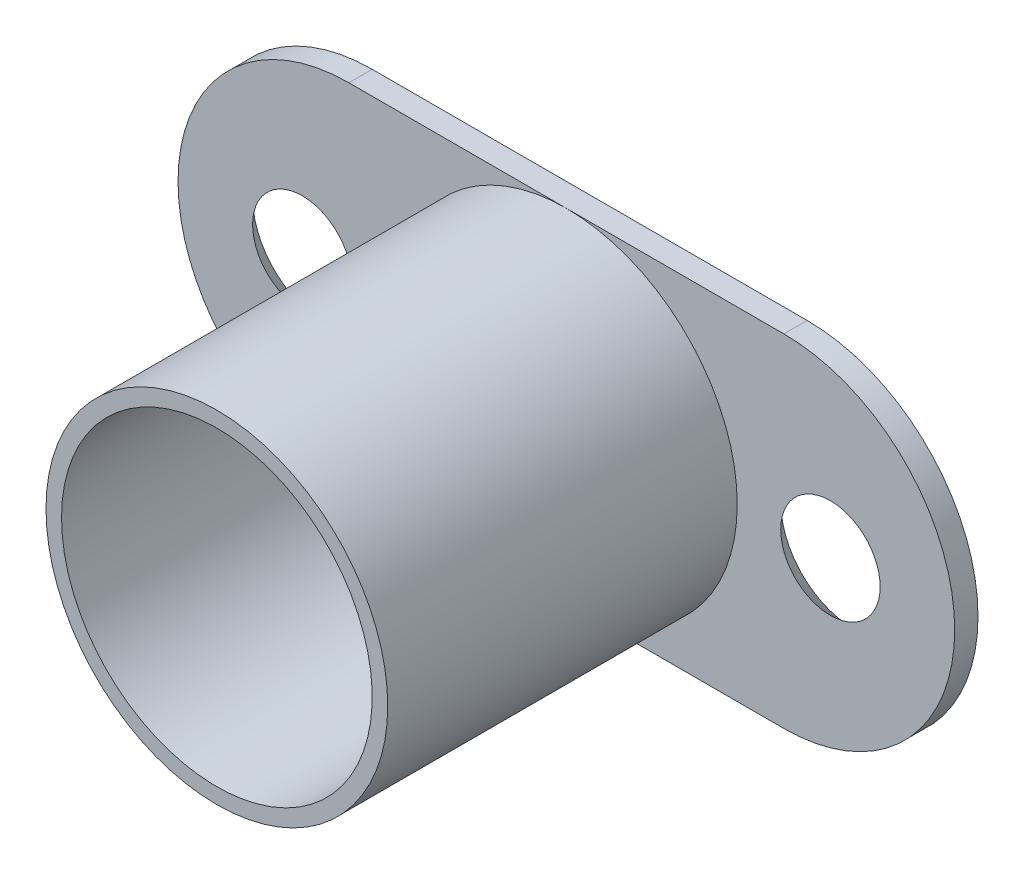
from build123d import *

# Parameters (mm, degrees)
BASE_EXTRUSION_DEPTH                           = 1.5
ESQUISSE2_R                                    = 11
ESQUISSE2_R_2                                  = 10
BOSS_EXTRU_MINCE1_DEPTH                        = 22.5
ESQUISSE3_R                                    = 3.6
ENL_V_MAT_EXTRU_1_DEPTH                        = 47.349217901
FRAISAGE_POUR_VIS_T_TE_FRAIS_E_M41_D           = 4.5
FRAISAGE_POUR_VIS_T_TE_FRAIS_E_M41_CSINK_D     = 9.4
FRAISAGE_POUR_VIS_T_TE_FRAIS_E_M41_CSINK_ANGLE = 90
FRAISAGE_POUR_VIS_T_TE_FRAIS_E_M42_D           = 4.5
FRAISAGE_POUR_VIS_T_TE_FRAIS_E_M42_CSINK_D     = 9.4
FRAISAGE_POUR_VIS_T_TE_FRAIS_E_M42_CSINK_ANGLE = 90


with BuildPart() as part:
    # Esquisse1 → Base-Extrusion (new body)
    with BuildSketch(Plane.XY):
        with BuildLine():
            Line((0, 11), (28, 11))
            ThreePointArc((28, 11), (39, 0), (28, -11))
            Line((28, -11), (0, -11))
            ThreePointArc((0, -11), (-11, 0), (0, 11))
        make_face()
    extrude(amount=-BASE_EXTRUSION_DEPTH)

    # Esquisse2 → Boss.-Extru.-Mince1 (add)
    with BuildSketch(Plane.XY):
        with Locations((14, 0)):
            Circle(ESQUISSE2_R)
        with Locations((14, 0)):
            Circle(ESQUISSE2_R_2, mode=Mode.SUBTRACT)
    extrude(amount=BOSS_EXTRU_MINCE1_DEPTH)

    # Esquisse3 → Enl_v. mat.-Extru.1 (cut, through all)
    with BuildSketch(Plane.XY):
        with Locations((14, 0)):
            Circle(ESQUISSE3_R)
    extrude(amount=-ENL_V_MAT_EXTRU_1_DEPTH, mode=Mode.SUBTRACT)

    # Fraisage pour vis _ t_te frais_e M41 (through all)
    with Locations(Plane(origin=(0, 0, -1.5), x_dir=(-1, 0, 0), z_dir=(0, 0, -1))):
        with Locations((3, 0)):
            CounterSinkHole(FRAISAGE_POUR_VIS_T_TE_FRAIS_E_M41_D / 2, FRAISAGE_POUR_VIS_T_TE_FRAIS_E_M41_CSINK_D / 2, counter_sink_angle=FRAISAGE_POUR_VIS_T_TE_FRAIS_E_M41_CSINK_ANGLE)

    # Fraisage pour vis _ t_te frais_e M42 (through all)
    with Locations(Plane(origin=(0, 0, -1.5), x_dir=(-1, 0, 0), z_dir=(0, 0, -1))):
        with Locations((-31, 0)):
            CounterSinkHole(FRAISAGE_POUR_VIS_T_TE_FRAIS_E_M42_D / 2, FRAISAGE_POUR_VIS_T_TE_FRAIS_E_M42_CSINK_D / 2, counter_sink_angle=FRAISAGE_POUR_VIS_T_TE_FRAIS_E_M42_CSINK_ANGLE)


solid = part.part
